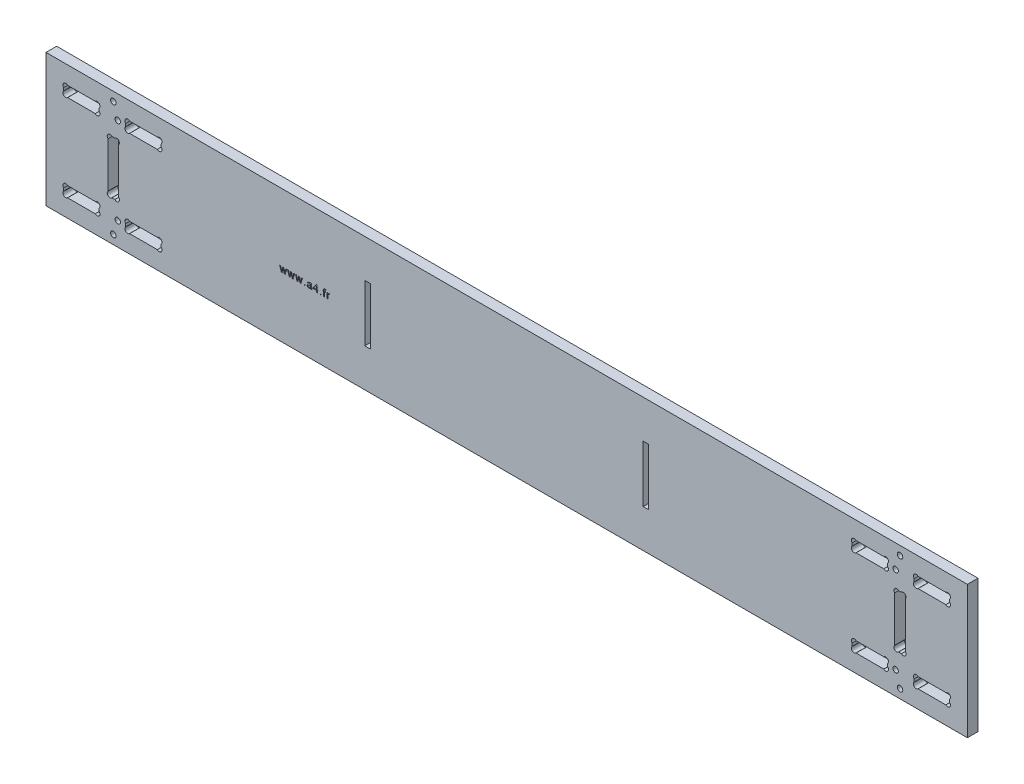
from build123d import *

# Parameters (mm, degrees)
ESQUISSE1_W             = 520
ESQUISSE1_H             = 75
ESQUISSE1_R             = 1.55
ESQUISSE1_W_2           = 3.1
ESQUISSE1_H_2           = 32
EXTRUSION1_DEPTH        = 6
ESQUISSE2_W             = 0.526834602
ESQUISSE2_H             = 0.526834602
ENL_V_MAT_EXTRU_1_DEPTH = 0.5
ESQUISSE3_W             = 0.012820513
ESQUISSE3_H             = 0.012820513
ENL_V_MAT_EXTRU_2_DEPTH = 0.5


with BuildPart() as part:
    # Esquisse1 → Extrusion1 (new body)
    with BuildSketch(Plane.XY):
        with Locations((260, 37.5)):
            Rectangle(ESQUISSE1_W, ESQUISSE1_H)
        with Locations((40.5, 13)):
            Circle(ESQUISSE1_R, mode=Mode.SUBTRACT)
        with Locations((38, 5)):
            Circle(ESQUISSE1_R, mode=Mode.SUBTRACT)
        with Locations(Location((40.5, 62, 0), (0, 0, 180))):
            Circle(ESQUISSE1_R, mode=Mode.SUBTRACT)
        with Locations(Location((38, 70, 0), (0, 0, 180))):
            Circle(ESQUISSE1_R, mode=Mode.SUBTRACT)
        with Locations(Location((482, 5, 0), (0, 0, 180))):
            Circle(ESQUISSE1_R, mode=Mode.SUBTRACT)
        with Locations((482, 70)):
            Circle(ESQUISSE1_R, mode=Mode.SUBTRACT)
        with Locations(Location((479.5, 13, 0), (0, 0, 180))):
            Circle(ESQUISSE1_R, mode=Mode.SUBTRACT)
        with Locations((479.5, 62)):
            Circle(ESQUISSE1_R, mode=Mode.SUBTRACT)
        with BuildLine():
            Line((45, 12.192031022), (45, 13.807968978))
            ThreePointArc((45, 13.807968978), (45, 16), (47.192031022, 16))
            Line((47.192031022, 16), (62.807968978, 16))
            ThreePointArc((62.807968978, 16), (65, 16), (65, 13.807968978))
            Line((65, 13.807968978), (65, 12.192031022))
            ThreePointArc((65, 12.192031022), (65, 10), (62.807968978, 10))
            Line((62.807968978, 10), (47.192031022, 10))
            ThreePointArc((47.192031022, 10), (45, 10), (45, 12.192031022))
        make_face(mode=Mode.SUBTRACT)
        with BuildLine():
            Line((12.192031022, 10), (27.807968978, 10))
            ThreePointArc((27.807968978, 10), (30, 10), (30, 12.192031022))
            Line((30, 12.192031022), (30, 13.807968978))
            ThreePointArc((30, 13.807968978), (30, 16), (27.807968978, 16))
            Line((27.807968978, 16), (12.192031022, 16))
            ThreePointArc((12.192031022, 16), (10, 16), (10, 13.807968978))
            Line((10, 13.807968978), (10, 12.192031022))
            ThreePointArc((10, 12.192031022), (10, 10), (12.192031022, 10))
        make_face(mode=Mode.SUBTRACT)
        with BuildLine():
            Line((65, 62.807968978), (65, 61.192031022))
            ThreePointArc((65, 61.192031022), (65, 59), (62.807968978, 59))
            Line((62.807968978, 59), (47.192031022, 59))
            ThreePointArc((47.192031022, 59), (45, 59), (45, 61.192031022))
            Line((45, 61.192031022), (45, 62.807968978))
            ThreePointArc((45, 62.807968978), (45, 65), (47.192031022, 65))
            Line((47.192031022, 65), (62.807968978, 65))
            ThreePointArc((62.807968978, 65), (65, 65), (65, 62.807968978))
        make_face(mode=Mode.SUBTRACT)
        with BuildLine():
            Line((30, 62.807968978), (30, 61.192031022))
            ThreePointArc((30, 61.192031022), (30, 59), (27.807968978, 59))
            Line((27.807968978, 59), (12.192031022, 59))
            ThreePointArc((12.192031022, 59), (10, 59), (10, 61.192031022))
            Line((10, 61.192031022), (10, 62.807968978))
            ThreePointArc((10, 62.807968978), (10, 65), (12.192031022, 65))
            Line((12.192031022, 65), (27.807968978, 65))
            ThreePointArc((27.807968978, 65), (30, 65), (30, 62.807968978))
        make_face(mode=Mode.SUBTRACT)
        with Locations((338.55, 37.5)):
            Rectangle(ESQUISSE1_W_2, ESQUISSE1_H_2, mode=Mode.SUBTRACT)
        with BuildLine():
            Line((37.192031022, 52.5), (38.807968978, 52.5))
            ThreePointArc((38.807968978, 52.5), (41, 52.5), (41, 50.307968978))
            Line((41, 50.307968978), (41, 24.692031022))
            ThreePointArc((41, 24.692031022), (41, 22.5), (38.807968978, 22.5))
            Line((38.807968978, 22.5), (37.192031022, 22.5))
            ThreePointArc((37.192031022, 22.5), (35, 22.5), (35, 24.692031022))
            Line((35, 24.692031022), (35, 50.307968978))
            ThreePointArc((35, 50.307968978), (35, 52.5), (37.192031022, 52.5))
        make_face(mode=Mode.SUBTRACT)
        with Locations((181.45, 37.5)):
            Rectangle(ESQUISSE1_W_2, ESQUISSE1_H_2, mode=Mode.SUBTRACT)
        with BuildLine():
            Line((485, 50.307968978), (485, 24.692031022))
            ThreePointArc((485, 24.692031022), (485, 22.5), (482.807968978, 22.5))
            Line((482.807968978, 22.5), (481.192031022, 22.5))
            ThreePointArc((481.192031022, 22.5), (479, 22.5), (479, 24.692031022))
            Line((479, 24.692031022), (479, 50.307968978))
            ThreePointArc((479, 50.307968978), (479, 52.5), (481.192031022, 52.5))
            Line((481.192031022, 52.5), (482.807968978, 52.5))
            ThreePointArc((482.807968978, 52.5), (485, 52.5), (485, 50.307968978))
        make_face(mode=Mode.SUBTRACT)
        with BuildLine():
            Line((455, 12.192031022), (455, 13.807968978))
            ThreePointArc((455, 13.807968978), (455, 16), (457.192031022, 16))
            Line((457.192031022, 16), (472.807968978, 16))
            ThreePointArc((472.807968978, 16), (475, 16), (475, 13.807968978))
            Line((475, 13.807968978), (475, 12.192031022))
            ThreePointArc((475, 12.192031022), (475, 10), (472.807968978, 10))
            Line((472.807968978, 10), (457.192031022, 10))
            ThreePointArc((457.192031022, 10), (455, 10), (455, 12.192031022))
        make_face(mode=Mode.SUBTRACT)
        with BuildLine():
            Line((490, 12.192031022), (490, 13.807968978))
            ThreePointArc((490, 13.807968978), (490, 16), (492.192031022, 16))
            Line((492.192031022, 16), (507.807968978, 16))
            ThreePointArc((507.807968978, 16), (510, 16), (510, 13.807968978))
            Line((510, 13.807968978), (510, 12.192031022))
            ThreePointArc((510, 12.192031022), (510, 10), (507.807968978, 10))
            Line((507.807968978, 10), (492.192031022, 10))
            ThreePointArc((492.192031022, 10), (490, 10), (490, 12.192031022))
        make_face(mode=Mode.SUBTRACT)
        with BuildLine():
            Line((510, 62.807968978), (510, 61.192031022))
            ThreePointArc((510, 61.192031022), (510, 59), (507.807968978, 59))
            Line((507.807968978, 59), (492.192031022, 59))
            ThreePointArc((492.192031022, 59), (490, 59), (490, 61.192031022))
            Line((490, 61.192031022), (490, 62.807968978))
            ThreePointArc((490, 62.807968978), (490, 65), (492.192031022, 65))
            Line((492.192031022, 65), (507.807968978, 65))
            ThreePointArc((507.807968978, 65), (510, 65), (510, 62.807968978))
        make_face(mode=Mode.SUBTRACT)
        with BuildLine():
            Line((475, 62.807968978), (475, 61.192031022))
            ThreePointArc((475, 61.192031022), (475, 59), (472.807968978, 59))
            Line((472.807968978, 59), (457.192031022, 59))
            ThreePointArc((457.192031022, 59), (455, 59), (455, 61.192031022))
            Line((455, 61.192031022), (455, 62.807968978))
            ThreePointArc((455, 62.807968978), (455, 65), (457.192031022, 65))
            Line((457.192031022, 65), (472.807968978, 65))
            ThreePointArc((472.807968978, 65), (475, 65), (475, 62.807968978))
        make_face(mode=Mode.SUBTRACT)
    extrude(amount=EXTRUSION1_DEPTH)

    # Esquisse2 → Enl_v. mat.-Extru.1 (cut)
    # profile 1 of 9: a face of its own
    with BuildSketch(Plane.XY.offset(6)):
        with BuildLine():
            Line((132.833430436, 33.973090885), (131.89582948, 36.976048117))
            Line((131.89582948, 36.976048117), (132.444066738, 36.976048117))
            Line((132.444066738, 36.976048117), (132.946205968, 35.225969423))
            Line((132.946205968, 35.225969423), (133.097670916, 34.597883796))
            add(Edge.make_bspline(
                [(133.097670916, 34.597883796), (133.099010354, 34.604476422), (133.102761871, 34.622941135), (133.111524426, 34.658432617), (133.122387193, 34.709956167), (133.138522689, 34.777071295), (133.15834293, 34.86013146), (133.181126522, 34.959250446), (133.207531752, 35.074269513), (133.226607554, 35.15600567), (133.236788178, 35.199627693)],
                knots=[0, 0, 0, 0, 0.261394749, 0.732117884, 1.420242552, 2.307348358, 3.414248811, 4.738505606, 6.259362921, 8, 8, 8, 8], degree=3))
            Line((133.236788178, 35.199627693), (133.681304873, 36.976048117))
            Line((133.681304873, 36.976048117), (134.226249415, 36.976048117))
            Line((134.226249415, 36.976048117), (134.668296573, 35.209505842))
            Line((134.668296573, 35.209505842), (134.793419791, 34.660445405))
            Line((134.793419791, 34.660445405), (134.949823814, 35.230085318))
            Line((134.949823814, 35.230085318), (135.45525576, 36.976048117))
            Line((135.45525576, 36.976048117), (136.005139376, 36.976048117))
            Line((136.005139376, 36.976048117), (135.115282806, 33.973090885))
            Line((135.115282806, 33.973090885), (134.502837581, 33.973090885))
            Line((134.502837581, 33.973090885), (134.073961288, 35.740456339))
            Line((134.073961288, 35.740456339), (133.950484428, 36.282931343))
            Line((133.950484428, 36.282931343), (133.397308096, 33.973090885))
            Line((133.397308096, 33.973090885), (132.833430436, 33.973090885))
        make_face()
    # profile 2 of 9: a face of its own
    with BuildSketch(Plane.XY.offset(6)):
        with BuildLine():
            Line((137.269377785, 33.973090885), (136.331776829, 36.976048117))
            Line((136.331776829, 36.976048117), (136.880014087, 36.976048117))
            Line((136.880014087, 36.976048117), (137.382153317, 35.225969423))
            Line((137.382153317, 35.225969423), (137.533618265, 34.597883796))
            add(Edge.make_bspline(
                [(137.533618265, 34.597883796), (137.534957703, 34.604476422), (137.53870922, 34.622941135), (137.547471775, 34.658432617), (137.558334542, 34.709956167), (137.574470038, 34.777071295), (137.594290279, 34.86013146), (137.617073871, 34.959250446), (137.643479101, 35.074269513), (137.662554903, 35.15600567), (137.672735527, 35.199627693)],
                knots=[0, 0, 0, 0, 0.261394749, 0.732117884, 1.420242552, 2.307348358, 3.414248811, 4.738505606, 6.259362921, 8, 8, 8, 8], degree=3))
            Line((137.672735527, 35.199627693), (138.117252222, 36.976048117))
            Line((138.117252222, 36.976048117), (138.662196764, 36.976048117))
            Line((138.662196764, 36.976048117), (139.104243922, 35.209505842))
            Line((139.104243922, 35.209505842), (139.22936714, 34.660445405))
            Line((139.22936714, 34.660445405), (139.385771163, 35.230085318))
            Line((139.385771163, 35.230085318), (139.891203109, 36.976048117))
            Line((139.891203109, 36.976048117), (140.441086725, 36.976048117))
            Line((140.441086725, 36.976048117), (139.551230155, 33.973090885))
            Line((139.551230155, 33.973090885), (138.93878493, 33.973090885))
            Line((138.93878493, 33.973090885), (138.509908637, 35.740456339))
            Line((138.509908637, 35.740456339), (138.386431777, 36.282931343))
            Line((138.386431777, 36.282931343), (137.833255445, 33.973090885))
            Line((137.833255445, 33.973090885), (137.269377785, 33.973090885))
        make_face()
    # profile 3 of 9: a face of its own
    with BuildSketch(Plane.XY.offset(6)):
        with BuildLine():
            Line((141.705325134, 33.973090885), (140.767724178, 36.976048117))
            Line((140.767724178, 36.976048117), (141.315961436, 36.976048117))
            Line((141.315961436, 36.976048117), (141.818100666, 35.225969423))
            Line((141.818100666, 35.225969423), (141.969565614, 34.597883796))
            add(Edge.make_bspline(
                [(141.969565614, 34.597883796), (141.970905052, 34.604476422), (141.974656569, 34.622941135), (141.983419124, 34.658432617), (141.994281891, 34.709956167), (142.010417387, 34.777071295), (142.030237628, 34.86013146), (142.05302122, 34.959250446), (142.07942645, 35.074269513), (142.098502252, 35.15600567), (142.108682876, 35.199627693)],
                knots=[0, 0, 0, 0, 0.261394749, 0.732117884, 1.420242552, 2.307348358, 3.414248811, 4.738505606, 6.259362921, 8, 8, 8, 8], degree=3))
            Line((142.108682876, 35.199627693), (142.553199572, 36.976048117))
            Line((142.553199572, 36.976048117), (143.098144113, 36.976048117))
            Line((143.098144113, 36.976048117), (143.540191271, 35.209505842))
            Line((143.540191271, 35.209505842), (143.665314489, 34.660445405))
            Line((143.665314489, 34.660445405), (143.821718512, 35.230085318))
            Line((143.821718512, 35.230085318), (144.327150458, 36.976048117))
            Line((144.327150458, 36.976048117), (144.877034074, 36.976048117))
            Line((144.877034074, 36.976048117), (143.987177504, 33.973090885))
            Line((143.987177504, 33.973090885), (143.374732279, 33.973090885))
            Line((143.374732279, 33.973090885), (142.945855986, 35.740456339))
            Line((142.945855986, 35.740456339), (142.822379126, 36.282931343))
            Line((142.822379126, 36.282931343), (142.269202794, 33.973090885))
            Line((142.269202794, 33.973090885), (141.705325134, 33.973090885))
        make_face()
    # profile 4 of 9: a face of its own
    with BuildSketch(Plane.XY.offset(6)):
        with Locations((146.02026516, 34.236508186)):
            Rectangle(ESQUISSE2_W, ESQUISSE2_H)
    # profile 5 of 9: a face of its own
    with BuildSketch(Plane.XY.offset(6)):
        with BuildLine():
            add(Edge.make_bspline(
                [(149.455226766, 34.341875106), (149.409054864, 34.305560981), (149.320099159, 34.235597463), (149.184205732, 34.145039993), (149.052870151, 34.070465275), (148.923470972, 34.013444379), (148.793601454, 33.971887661), (148.661112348, 33.942246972), (148.523931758, 33.923380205), (148.430704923, 33.921407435), (148.383447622, 33.920407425)],
                knots=[0, 0, 0, 0, 1.197047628, 2.306255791, 3.325459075, 4.272204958, 5.183179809, 6.100503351, 7.037132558, 8, 8, 8, 8], degree=3))
            add(Edge.make_bspline(
                [(148.383447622, 33.920407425), (148.345011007, 33.921303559), (148.270455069, 33.923041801), (148.161922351, 33.933424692), (148.060307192, 33.952347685), (147.965438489, 33.978910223), (147.876648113, 34.011163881), (147.795515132, 34.052963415), (147.72093174, 34.101368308), (147.654221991, 34.157679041), (147.595090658, 34.219576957), (147.542731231, 34.285409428), (147.499011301, 34.356053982), (147.462425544, 34.430335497), (147.434215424, 34.509307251), (147.414740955, 34.592437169), (147.403021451, 34.679594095), (147.401398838, 34.738885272), (147.400571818, 34.769105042)],
                knots=[0, 0, 0, 0, 1.258692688, 2.441500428, 3.565802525, 4.638326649, 5.664695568, 6.653201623, 7.620115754, 8.570354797, 9.504485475, 10.41940588, 11.319425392, 12.219534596, 13.126122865, 14.058869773, 15.010636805, 16, 16, 16, 16], degree=3))
            add(Edge.make_bspline(
                [(147.400571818, 34.769105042), (147.401553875, 34.804862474), (147.403485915, 34.875209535), (147.422498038, 34.977955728), (147.451790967, 35.076091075), (147.494230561, 35.168054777), (147.545723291, 35.253320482), (147.605585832, 35.33046478), (147.672081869, 35.399447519), (147.747351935, 35.458007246), (147.828113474, 35.508569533), (147.913518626, 35.553582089), (148.003942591, 35.591440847), (148.066901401, 35.611158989), (148.098627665, 35.621095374)],
                knots=[0, 0, 0, 0, 1.081160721, 2.127011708, 3.15154375, 4.173548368, 5.183333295, 6.160067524, 7.123185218, 8.075175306, 9.03822139, 10.004020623, 10.994184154, 12, 12, 12, 12], degree=3))
            add(Edge.make_bspline(
                [(148.098627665, 35.621095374), (148.125450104, 35.627989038), (148.185015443, 35.643297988), (148.284476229, 35.660947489), (148.401809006, 35.680441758), (148.486297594, 35.691106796), (148.531619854, 35.696827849)],
                knots=[0, 0, 0, 0, 0.755247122, 1.677198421, 2.753978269, 4, 4, 4, 4], degree=3))
            add(Edge.make_bspline(
                [(148.531619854, 35.696827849), (148.579097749, 35.703076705), (148.670819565, 35.715148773), (148.803782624, 35.733676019), (148.926978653, 35.754258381), (149.040491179, 35.775907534), (149.144512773, 35.796636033), (149.238298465, 35.819909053), (149.322713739, 35.843438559), (149.375172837, 35.861243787), (149.400073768, 35.869695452)],
                knots=[0, 0, 0, 0, 1.295688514, 2.50312072, 3.632112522, 4.674678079, 5.629835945, 6.501350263, 7.28863104, 8, 8, 8, 8], degree=3))
            add(Edge.make_bspline(
                [(149.400073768, 35.869695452), (149.400352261, 35.884238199), (149.400856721, 35.910580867), (149.40147557, 35.945707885), (149.402685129, 35.972037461), (149.402583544, 35.986586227), (149.402543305, 35.992349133)],
                knots=[0, 0, 0, 0, 1.422721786, 2.577112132, 3.436380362, 4, 4, 4, 4], degree=3))
            add(Edge.make_bspline(
                [(149.402543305, 35.992349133), (149.401946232, 36.015405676), (149.400799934, 36.059671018), (149.395522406, 36.123615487), (149.384680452, 36.182247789), (149.37007071, 36.235760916), (149.351529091, 36.284264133), (149.326967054, 36.326224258), (149.300130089, 36.364525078), (149.277812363, 36.385353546), (149.26671876, 36.395706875)],
                knots=[0, 0, 0, 0, 1.26154989, 2.42199954, 3.505345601, 4.517638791, 5.454101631, 6.334651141, 7.172195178, 8, 8, 8, 8], degree=3))
            add(Edge.make_bspline(
                [(149.26671876, 36.395706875), (149.250851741, 36.408522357), (149.218407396, 36.434727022), (149.162557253, 36.465857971), (149.102684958, 36.494414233), (149.036562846, 36.516546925), (148.965177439, 36.533545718), (148.888127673, 36.54580963), (148.80561231, 36.553276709), (148.748681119, 36.554136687), (148.719304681, 36.554580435)],
                knots=[0, 0, 0, 0, 0.839762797, 1.717118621, 2.62848608, 3.573318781, 4.586191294, 5.652292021, 6.78858503, 8, 8, 8, 8], degree=3))
            add(Edge.make_bspline(
                [(148.719304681, 36.554580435), (148.691856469, 36.554300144), (148.639107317, 36.553761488), (148.562469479, 36.54864729), (148.491532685, 36.540772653), (148.425811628, 36.529228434), (148.366161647, 36.514547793), (148.31145853, 36.497262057), (148.262462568, 36.476312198), (148.204220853, 36.442660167), (148.138682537, 36.388729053), (148.074517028, 36.303326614), (148.018196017, 36.200251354), (147.993269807, 36.121872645), (147.98008988, 36.080429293)],
                knots=[0, 0, 0, 0, 1.022193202, 1.964420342, 2.859404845, 3.679355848, 4.447752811, 5.145854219, 5.814144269, 6.427678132, 7.647232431, 8.943346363, 10.383770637, 12, 12, 12, 12], degree=3))
            Line((147.98008988, 36.080429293), (147.453255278, 36.133112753))
            add(Edge.make_bspline(
                [(147.453255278, 36.133112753), (147.465343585, 36.182547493), (147.488685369, 36.278002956), (147.540045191, 36.411135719), (147.602207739, 36.529368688), (147.675036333, 36.634913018), (147.764555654, 36.725949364), (147.869556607, 36.806085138), (147.992779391, 36.872894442), (148.131640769, 36.929580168), (148.285051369, 36.974270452), (148.451238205, 37.00603485), (148.628862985, 37.025006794), (148.751086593, 37.027466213), (148.813970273, 37.028731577)],
                knots=[0, 0, 0, 0, 1.021253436, 1.971977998, 2.856928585, 3.699335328, 4.537187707, 5.410097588, 6.342486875, 7.343316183, 8.417452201, 9.545747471, 10.737294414, 12, 12, 12, 12], degree=3))
            add(Edge.make_bspline(
                [(148.813970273, 37.028731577), (148.875472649, 37.027656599), (148.992680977, 37.025607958), (149.159294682, 37.009538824), (149.308059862, 36.982241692), (149.438635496, 36.942698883), (149.552141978, 36.894598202), (149.650141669, 36.841665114), (149.732175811, 36.782149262), (149.79903957, 36.715669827), (149.852679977, 36.641295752), (149.89604284, 36.559008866), (149.932260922, 36.468312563), (149.948267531, 36.403629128), (149.956542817, 36.370188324)],
                knots=[0, 0, 0, 0, 1.532418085, 2.920410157, 4.166262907, 5.295392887, 6.3126657, 7.233843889, 8.065362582, 8.82930282, 9.573337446, 10.341184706, 11.142406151, 12, 12, 12, 12], degree=3))
            add(Edge.make_bspline(
                [(149.956542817, 36.370188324), (149.960797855, 36.344717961), (149.970587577, 36.286117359), (149.976061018, 36.185290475), (149.981531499, 36.060738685), (149.981874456, 35.969587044), (149.982061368, 35.919909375)],
                knots=[0, 0, 0, 0, 0.685842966, 1.577944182, 2.67997895, 4, 4, 4, 4], degree=3))
            Line((149.982061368, 35.919909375), (149.982061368, 35.277006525))
            add(Edge.make_bspline(
                [(149.982061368, 35.277006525), (149.982364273, 35.223225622), (149.982942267, 35.120602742), (149.983323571, 34.973793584), (149.985586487, 34.841512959), (149.990172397, 34.723275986), (149.99396005, 34.619255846), (149.998538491, 34.529192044), (150.005070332, 34.453709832), (150.01473432, 34.372199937), (150.031584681, 34.280802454), (150.060132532, 34.175936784), (150.094824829, 34.072605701), (150.124984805, 34.006331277), (150.140111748, 33.973090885)],
                knots=[0, 0, 0, 0, 1.460752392, 2.787357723, 3.987454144, 5.053844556, 6.001073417, 6.814649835, 7.502887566, 8.058452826, 9.043678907, 10.023506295, 11.008675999, 12, 12, 12, 12], degree=3))
            Line((150.140111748, 33.973090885), (149.613277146, 33.973090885))
            add(Edge.make_bspline(
                [(149.613277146, 33.973090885), (149.593776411, 34.000017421), (149.554804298, 34.053829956), (149.511177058, 34.144392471), (149.475256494, 34.240034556), (149.461969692, 34.307590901), (149.455226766, 34.341875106)],
                knots=[0, 0, 0, 0, 0.98283144, 1.964183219, 2.966842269, 4, 4, 4, 4], degree=3))
        make_face()
        with BuildLine():
            add(Edge.make_bspline(
                [(149.402543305, 35.395544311), (149.379315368, 35.387281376), (149.330295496, 35.369843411), (149.251230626, 35.348848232), (149.164843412, 35.325790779), (149.06956216, 35.305976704), (148.966559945, 35.284993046), (148.854741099, 35.266377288), (148.735086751, 35.248299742), (148.652371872, 35.237359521), (148.609821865, 35.231731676)],
                knots=[0, 0, 0, 0, 0.729352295, 1.539213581, 2.419656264, 3.375381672, 4.41857158, 5.530700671, 6.729748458, 8, 8, 8, 8], degree=3))
            add(Edge.make_bspline(
                [(148.609821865, 35.231731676), (148.563388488, 35.225546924), (148.47768549, 35.214131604), (148.360705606, 35.192805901), (148.265485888, 35.171070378), (148.189400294, 35.148106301), (148.127579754, 35.121030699), (148.076371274, 35.08739859), (148.030988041, 35.049677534), (147.994119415, 35.00554841), (147.964005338, 34.958140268), (147.943715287, 34.906915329), (147.929414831, 34.853845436), (147.928079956, 34.817219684), (147.92740642, 34.798739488)],
                knots=[0, 0, 0, 0, 1.886220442, 3.481434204, 4.78676141, 5.817751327, 6.678319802, 7.493641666, 8.277504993, 9.045791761, 9.800124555, 10.528599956, 11.257578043, 12, 12, 12, 12], degree=3))
            add(Edge.make_bspline(
                [(147.92740642, 34.798739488), (147.928958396, 34.770755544), (147.932008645, 34.715756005), (147.962045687, 34.638024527), (148.008790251, 34.567719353), (148.073798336, 34.505542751), (148.157509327, 34.455308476), (148.258370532, 34.419223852), (148.375742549, 34.39842027), (148.459366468, 34.395895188), (148.503631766, 34.394558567)],
                knots=[0, 0, 0, 0, 0.849267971, 1.669148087, 2.501462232, 3.405991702, 4.385156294, 5.453560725, 6.652073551, 8, 8, 8, 8], degree=3))
            add(Edge.make_bspline(
                [(148.503631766, 34.394558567), (148.549029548, 34.395751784), (148.63801941, 34.398090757), (148.76731623, 34.423266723), (148.889478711, 34.461302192), (149.001755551, 34.516192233), (149.103204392, 34.581201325), (149.191027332, 34.654865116), (149.265821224, 34.735193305), (149.303311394, 34.795866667), (149.321871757, 34.825904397)],
                knots=[0, 0, 0, 0, 1.124426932, 2.204129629, 3.254288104, 4.289056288, 5.293189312, 6.235005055, 7.126199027, 8, 8, 8, 8], degree=3))
            add(Edge.make_bspline(
                [(149.321871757, 34.825904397), (149.33438745, 34.851889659), (149.361300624, 34.907767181), (149.382478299, 35.005620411), (149.397968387, 35.118439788), (149.399340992, 35.199277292), (149.400073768, 35.242433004)],
                knots=[0, 0, 0, 0, 0.806621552, 1.73452216, 2.790557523, 4, 4, 4, 4], degree=3))
            Line((149.400073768, 35.242433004), (149.402543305, 35.395544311))
        make_face(mode=Mode.SUBTRACT)
    # profile 6 of 9: a face of its own
    with BuildSketch(Plane.XY.offset(6)):
        Polygon((152.57408761, 33.973090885), (152.57408761, 34.974076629), (150.782849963, 34.974076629), (150.782849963, 35.500911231), (152.73213799, 38.029717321), (153.100922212, 38.029717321), (153.100922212, 35.500911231), (153.627756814, 35.500911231), (153.627756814, 34.974076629), (153.100922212, 34.974076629), (153.100922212, 33.973090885), align=None)
        Polygon((152.57408761, 35.500911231), (152.57408761, 36.980987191), (151.433161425, 35.500911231), align=None, mode=Mode.SUBTRACT)
    # profile 7 of 9: a face of its own
    with BuildSketch(Plane.XY.offset(6)):
        with Locations((155.060746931, 34.236508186)):
            Rectangle(ESQUISSE2_W, ESQUISSE2_H)
    # profile 8 of 9: a face of its own
    with BuildSketch(Plane.XY.offset(6)):
        with BuildLine():
            Line((156.725050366, 33.973090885), (156.725050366, 36.501896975))
            Line((156.725050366, 36.501896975), (156.303582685, 36.501896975))
            Line((156.303582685, 36.501896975), (156.303582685, 36.976048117))
            Line((156.303582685, 36.976048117), (156.725050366, 36.976048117))
            Line((156.725050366, 36.976048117), (156.725050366, 37.28144755))
            add(Edge.make_bspline(
                [(156.725050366, 37.28144755), (156.725470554, 37.326486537), (156.726255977, 37.410674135), (156.737249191, 37.527474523), (156.752477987, 37.626823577), (156.772077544, 37.684714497), (156.781026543, 37.711147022)],
                knots=[0, 0, 0, 0, 1.240410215, 2.318594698, 3.232283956, 4, 4, 4, 4], degree=3))
            add(Edge.make_bspline(
                [(156.781026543, 37.711147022), (156.795100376, 37.741624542), (156.823353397, 37.802807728), (156.884744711, 37.885011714), (156.961234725, 37.956984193), (157.050755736, 38.021215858), (157.156629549, 38.074093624), (157.280548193, 38.108955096), (157.420362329, 38.131495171), (157.519318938, 38.133848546), (157.571278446, 38.135084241)],
                knots=[0, 0, 0, 0, 0.841887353, 1.690076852, 2.558213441, 3.472839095, 4.450413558, 5.515111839, 6.695250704, 8, 8, 8, 8], degree=3))
            add(Edge.make_bspline(
                [(157.571278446, 38.135084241), (157.607522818, 38.134444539), (157.681784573, 38.133133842), (157.795706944, 38.122231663), (157.915383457, 38.107349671), (157.996395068, 38.091412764), (158.038020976, 38.08322396)],
                knots=[0, 0, 0, 0, 0.924505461, 1.89423605, 2.918002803, 4, 4, 4, 4], degree=3))
            Line((158.038020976, 38.08322396), (157.963111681, 37.634591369))
            add(Edge.make_bspline(
                [(157.963111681, 37.634591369), (157.912719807, 37.642272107), (157.815025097, 37.657162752), (157.716242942, 37.659703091), (157.668413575, 37.660933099)],
                knots=[0, 0, 0, 0, 1.031619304, 2, 2, 2, 2], degree=3))
            add(Edge.make_bspline(
                [(157.668413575, 37.660933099), (157.633198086, 37.660042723), (157.567758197, 37.658388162), (157.477749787, 37.641176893), (157.402857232, 37.614191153), (157.343117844, 37.572338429), (157.299442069, 37.512658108), (157.272185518, 37.434804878), (157.25407328, 37.339080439), (157.252655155, 37.268657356), (157.251884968, 37.230410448)],
                knots=[0, 0, 0, 0, 1.201235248, 2.232219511, 3.116244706, 3.901648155, 4.685036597, 5.598662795, 6.695829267, 8, 8, 8, 8], degree=3))
            Line((157.251884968, 37.230410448), (157.251884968, 36.976048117))
            Line((157.251884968, 36.976048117), (157.77871957, 36.976048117))
            Line((157.77871957, 36.976048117), (157.77871957, 36.501896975))
            Line((157.77871957, 36.501896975), (157.251884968, 36.501896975))
            Line((157.251884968, 36.501896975), (157.251884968, 33.973090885))
            Line((157.251884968, 33.973090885), (156.725050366, 33.973090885))
        make_face()
    # profile 9 of 9: a face of its own
    with BuildSketch(Plane.XY.offset(6)):
        with BuildLine():
            Line((158.558928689, 33.973090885), (158.558928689, 36.976048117))
            Line((158.558928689, 36.976048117), (159.03307983, 36.976048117))
            Line((159.03307983, 36.976048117), (159.03307983, 36.557049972))
            add(Edge.make_bspline(
                [(159.03307983, 36.557049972), (159.059602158, 36.601367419), (159.108738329, 36.683471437), (159.186235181, 36.791663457), (159.259972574, 36.876400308), (159.334409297, 36.936778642), (159.4089001, 36.978565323), (159.484963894, 37.007333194), (159.564544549, 37.025607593), (159.618810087, 37.027679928), (159.646348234, 37.028731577)],
                knots=[0, 0, 0, 0, 1.517336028, 2.811068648, 3.907416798, 4.807929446, 5.613162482, 6.406966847, 7.191583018, 8, 8, 8, 8], degree=3))
            add(Edge.make_bspline(
                [(159.646348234, 37.028731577), (159.687105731, 37.026912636), (159.769716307, 37.023225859), (159.893494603, 36.994931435), (160.018737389, 36.952033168), (160.098507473, 36.909691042), (160.139432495, 36.887967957)],
                knots=[0, 0, 0, 0, 0.943117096, 1.911585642, 2.928565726, 4, 4, 4, 4], degree=3))
            Line((160.139432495, 36.887967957), (159.974796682, 36.431103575))
            add(Edge.make_bspline(
                [(159.974796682, 36.431103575), (159.946214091, 36.450107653), (159.891089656, 36.486758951), (159.802700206, 36.525576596), (159.714381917, 36.550351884), (159.655008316, 36.553185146), (159.625768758, 36.554580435)],
                knots=[0, 0, 0, 0, 1.093324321, 2.108587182, 3.068540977, 4, 4, 4, 4], degree=3))
            add(Edge.make_bspline(
                [(159.625768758, 36.554580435), (159.600405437, 36.553291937), (159.550326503, 36.550747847), (159.477154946, 36.530987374), (159.408313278, 36.498328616), (159.343854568, 36.453776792), (159.286525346, 36.397462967), (159.23620842, 36.331603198), (159.195547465, 36.255040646), (159.176875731, 36.199014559), (159.167258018, 36.170155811)],
                knots=[0, 0, 0, 0, 0.946345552, 1.868524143, 2.808299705, 3.780481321, 4.780563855, 5.797153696, 6.865325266, 8, 8, 8, 8], degree=3))
            add(Edge.make_bspline(
                [(159.167258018, 36.170155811), (159.154697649, 36.123404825), (159.129196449, 36.028486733), (159.104711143, 35.880791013), (159.08815613, 35.726842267), (159.086572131, 35.621965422), (159.085763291, 35.568411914)],
                knots=[0, 0, 0, 0, 0.953038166, 1.934944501, 2.945515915, 4, 4, 4, 4], degree=3))
            Line((159.085763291, 35.568411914), (159.085763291, 33.973090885))
            Line((159.085763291, 33.973090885), (158.558928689, 33.973090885))
        make_face()
    extrude(amount=-ENL_V_MAT_EXTRU_1_DEPTH, mode=Mode.SUBTRACT)

    # Esquisse3 → Enl_v. mat.-Extru.2 (cut)
    # profile 1 of 9: a face of its own
    with BuildSketch(Plane.XY.offset(3)):
        with BuildLine():
            Line((0.071577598, 0.053550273), (0.048761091, 0.126627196))
            Line((0.048761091, 0.126627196), (0.062102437, 0.126627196))
            Line((0.062102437, 0.126627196), (0.074321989, 0.084039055))
            Line((0.074321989, 0.084039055), (0.078007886, 0.0687546))
            add(Edge.make_bspline(
                [(0.078007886, 0.0687546), (0.078040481, 0.068915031), (0.078131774, 0.06936437), (0.078345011, 0.070228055), (0.078609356, 0.07148188), (0.079002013, 0.073115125), (0.079484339, 0.075136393), (0.080038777, 0.077548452), (0.080681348, 0.08034744), (0.081145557, 0.082336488), (0.081393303, 0.083398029)],
                knots=[0, 0, 0, 0, 0.261394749, 0.732117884, 1.420242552, 2.307348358, 3.414248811, 4.738505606, 6.259362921, 8, 8, 8, 8], degree=3))
            Line((0.081393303, 0.083398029), (0.09221061, 0.126627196))
            Line((0.09221061, 0.126627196), (0.105471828, 0.126627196))
            Line((0.105471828, 0.126627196), (0.11622904, 0.083638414))
            Line((0.11622904, 0.083638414), (0.119273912, 0.070277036))
            Line((0.119273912, 0.070277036), (0.123080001, 0.084139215))
            Line((0.123080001, 0.084139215), (0.135379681, 0.126627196))
            Line((0.135379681, 0.126627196), (0.148761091, 0.126627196))
            Line((0.148761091, 0.126627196), (0.127106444, 0.053550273))
            Line((0.127106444, 0.053550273), (0.112202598, 0.053550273))
            Line((0.112202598, 0.053550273), (0.101765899, 0.096559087))
            Line((0.101765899, 0.096559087), (0.098761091, 0.109760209))
            Line((0.098761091, 0.109760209), (0.085299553, 0.053550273))
            Line((0.085299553, 0.053550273), (0.071577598, 0.053550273))
        make_face()
    # profile 2 of 9: a face of its own
    with BuildSketch(Plane.XY.offset(3)):
        with BuildLine():
            Line((0.170295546, 0.053550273), (0.14747904, 0.126627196))
            Line((0.14747904, 0.126627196), (0.160820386, 0.126627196))
            Line((0.160820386, 0.126627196), (0.173039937, 0.084039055))
            Line((0.173039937, 0.084039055), (0.176725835, 0.0687546))
            add(Edge.make_bspline(
                [(0.176725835, 0.0687546), (0.17675843, 0.068915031), (0.176849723, 0.06936437), (0.17706296, 0.070228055), (0.177327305, 0.07148188), (0.177719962, 0.073115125), (0.178202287, 0.075136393), (0.178756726, 0.077548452), (0.179399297, 0.08034744), (0.179863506, 0.082336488), (0.180111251, 0.083398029)],
                knots=[0, 0, 0, 0, 0.261394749, 0.732117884, 1.420242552, 2.307348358, 3.414248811, 4.738505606, 6.259362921, 8, 8, 8, 8], degree=3))
            Line((0.180111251, 0.083398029), (0.190928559, 0.126627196))
            Line((0.190928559, 0.126627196), (0.204189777, 0.126627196))
            Line((0.204189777, 0.126627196), (0.214946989, 0.083638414))
            Line((0.214946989, 0.083638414), (0.21799186, 0.070277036))
            Line((0.21799186, 0.070277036), (0.22179795, 0.084139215))
            Line((0.22179795, 0.084139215), (0.23409763, 0.126627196))
            Line((0.23409763, 0.126627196), (0.24747904, 0.126627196))
            Line((0.24747904, 0.126627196), (0.225824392, 0.053550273))
            Line((0.225824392, 0.053550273), (0.210920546, 0.053550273))
            Line((0.210920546, 0.053550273), (0.200483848, 0.096559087))
            Line((0.200483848, 0.096559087), (0.19747904, 0.109760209))
            Line((0.19747904, 0.109760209), (0.184017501, 0.053550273))
            Line((0.184017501, 0.053550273), (0.170295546, 0.053550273))
        make_face()
    # profile 3 of 9: a face of its own
    with BuildSketch(Plane.XY.offset(3)):
        with BuildLine():
            Line((0.269013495, 0.053550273), (0.246196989, 0.126627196))
            Line((0.246196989, 0.126627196), (0.259538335, 0.126627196))
            Line((0.259538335, 0.126627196), (0.271757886, 0.084039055))
            Line((0.271757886, 0.084039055), (0.275443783, 0.0687546))
            add(Edge.make_bspline(
                [(0.275443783, 0.0687546), (0.275476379, 0.068915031), (0.275567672, 0.06936437), (0.275780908, 0.070228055), (0.276045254, 0.07148188), (0.276437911, 0.073115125), (0.276920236, 0.075136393), (0.277474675, 0.077548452), (0.278117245, 0.08034744), (0.278581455, 0.082336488), (0.2788292, 0.083398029)],
                knots=[0, 0, 0, 0, 0.261394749, 0.732117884, 1.420242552, 2.307348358, 3.414248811, 4.738505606, 6.259362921, 8, 8, 8, 8], degree=3))
            Line((0.2788292, 0.083398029), (0.289646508, 0.126627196))
            Line((0.289646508, 0.126627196), (0.302907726, 0.126627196))
            Line((0.302907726, 0.126627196), (0.313664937, 0.083638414))
            Line((0.313664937, 0.083638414), (0.316709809, 0.070277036))
            Line((0.316709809, 0.070277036), (0.320515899, 0.084139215))
            Line((0.320515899, 0.084139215), (0.332815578, 0.126627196))
            Line((0.332815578, 0.126627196), (0.346196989, 0.126627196))
            Line((0.346196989, 0.126627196), (0.324542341, 0.053550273))
            Line((0.324542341, 0.053550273), (0.309638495, 0.053550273))
            Line((0.309638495, 0.053550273), (0.299201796, 0.096559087))
            Line((0.299201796, 0.096559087), (0.296196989, 0.109760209))
            Line((0.296196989, 0.109760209), (0.28273545, 0.053550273))
            Line((0.28273545, 0.053550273), (0.269013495, 0.053550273))
        make_face()
    # profile 4 of 9: a face of its own
    with BuildSketch(Plane.XY.offset(3)):
        with Locations((0.364786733, 0.059960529)):
            Rectangle(ESQUISSE3_W, ESQUISSE3_H)
    # profile 5 of 9: a face of its own
    with BuildSketch(Plane.XY.offset(3)):
        with BuildLine():
            add(Edge.make_bspline(
                [(0.439145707, 0.062524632), (0.438022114, 0.061640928), (0.435857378, 0.059938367), (0.432550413, 0.057734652), (0.429354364, 0.055919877), (0.426205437, 0.054532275), (0.423045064, 0.053520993), (0.419820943, 0.052799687), (0.416482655, 0.052340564), (0.414213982, 0.052292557), (0.413063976, 0.052268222)],
                knots=[0, 0, 0, 0, 1.197047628, 2.306255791, 3.325459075, 4.272204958, 5.183179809, 6.100503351, 7.037132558, 8, 8, 8, 8], degree=3))
            add(Edge.make_bspline(
                [(0.413063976, 0.052268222), (0.412128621, 0.052290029), (0.410314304, 0.052332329), (0.407673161, 0.052584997), (0.405200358, 0.053045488), (0.402891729, 0.053691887), (0.400731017, 0.054476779), (0.398756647, 0.05549397), (0.396941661, 0.056671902), (0.39531828, 0.058042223), (0.39387932, 0.059548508), (0.392605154, 0.06115054), (0.39154123, 0.062869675), (0.390650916, 0.064677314), (0.389964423, 0.066599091), (0.389490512, 0.068622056), (0.389205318, 0.070743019), (0.389165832, 0.072185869), (0.389145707, 0.072921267)],
                knots=[0, 0, 0, 0, 1.258692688, 2.441500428, 3.565802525, 4.638326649, 5.664695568, 6.653201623, 7.620115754, 8.570354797, 9.504485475, 10.41940588, 11.319425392, 12.219534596, 13.126122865, 14.058869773, 15.010636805, 16, 16, 16, 16], degree=3))
            add(Edge.make_bspline(
                [(0.389145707, 0.072921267), (0.389169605, 0.073791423), (0.389216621, 0.075503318), (0.389679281, 0.078003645), (0.390392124, 0.080391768), (0.391424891, 0.082629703), (0.392677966, 0.084704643), (0.39413472, 0.086581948), (0.3957529, 0.088260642), (0.397584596, 0.089685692), (0.399549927, 0.090916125), (0.40162826, 0.092011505), (0.403828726, 0.092932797), (0.405360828, 0.093412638), (0.406132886, 0.09365444)],
                knots=[0, 0, 0, 0, 1.081160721, 2.127011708, 3.15154375, 4.173548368, 5.183333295, 6.160067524, 7.123185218, 8.075175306, 9.03822139, 10.004020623, 10.994184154, 12, 12, 12, 12], degree=3))
            add(Edge.make_bspline(
                [(0.406132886, 0.09365444), (0.40678561, 0.093822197), (0.408235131, 0.09419474), (0.410655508, 0.09462424), (0.4135108, 0.095098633), (0.415566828, 0.095358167), (0.416669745, 0.095497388)],
                knots=[0, 0, 0, 0, 0.755247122, 1.677198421, 2.753978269, 4, 4, 4, 4], degree=3))
            add(Edge.make_bspline(
                [(0.416669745, 0.095497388), (0.417825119, 0.095649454), (0.420057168, 0.095943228), (0.423292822, 0.096394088), (0.426290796, 0.09689496), (0.429053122, 0.097421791), (0.431584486, 0.097926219), (0.433866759, 0.098492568), (0.435921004, 0.099065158), (0.437197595, 0.099498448), (0.437803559, 0.099704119)],
                knots=[0, 0, 0, 0, 1.295688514, 2.50312072, 3.632112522, 4.674678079, 5.629835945, 6.501350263, 7.28863104, 8, 8, 8, 8], degree=3))
            add(Edge.make_bspline(
                [(0.437803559, 0.099704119), (0.437810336, 0.100058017), (0.437822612, 0.100699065), (0.437837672, 0.101553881), (0.437867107, 0.102194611), (0.437864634, 0.102548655), (0.437863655, 0.102688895)],
                knots=[0, 0, 0, 0, 1.422721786, 2.577112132, 3.436380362, 4, 4, 4, 4], degree=3))
            add(Edge.make_bspline(
                [(0.437863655, 0.102688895), (0.437849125, 0.103249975), (0.43782123, 0.104327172), (0.437692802, 0.10588326), (0.437428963, 0.107310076), (0.437073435, 0.108612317), (0.436622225, 0.109792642), (0.436024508, 0.110813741), (0.435371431, 0.111745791), (0.434828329, 0.112252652), (0.434558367, 0.1125046)],
                knots=[0, 0, 0, 0, 1.26154989, 2.42199954, 3.505345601, 4.517638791, 5.454101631, 6.334651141, 7.172195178, 8, 8, 8, 8], degree=3))
            add(Edge.make_bspline(
                [(0.434558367, 0.1125046), (0.434172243, 0.112816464), (0.43338271, 0.113454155), (0.432023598, 0.114211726), (0.430566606, 0.114906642), (0.428957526, 0.115445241), (0.427220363, 0.115858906), (0.425345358, 0.116157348), (0.423337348, 0.11633906), (0.421951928, 0.116359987), (0.421237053, 0.116370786)],
                knots=[0, 0, 0, 0, 0.839762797, 1.717118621, 2.62848608, 3.573318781, 4.586191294, 5.652292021, 6.78858503, 8, 8, 8, 8], degree=3))
            add(Edge.make_bspline(
                [(0.421237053, 0.116370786), (0.420569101, 0.116363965), (0.419285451, 0.116350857), (0.41742047, 0.116226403), (0.415694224, 0.116034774), (0.414094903, 0.115753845), (0.412643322, 0.115396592), (0.411312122, 0.114975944), (0.410119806, 0.114466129), (0.408702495, 0.113647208), (0.407107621, 0.112334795), (0.405546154, 0.110256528), (0.404175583, 0.107748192), (0.403569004, 0.105840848), (0.403248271, 0.104832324)],
                knots=[0, 0, 0, 0, 1.022193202, 1.964420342, 2.859404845, 3.679355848, 4.447752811, 5.145854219, 5.814144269, 6.427678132, 7.647232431, 8.943346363, 10.383770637, 12, 12, 12, 12], degree=3))
            Line((0.403248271, 0.104832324), (0.390427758, 0.106114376))
            add(Edge.make_bspline(
                [(0.390427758, 0.106114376), (0.390721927, 0.107317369), (0.391289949, 0.109640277), (0.392539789, 0.112880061), (0.394052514, 0.115757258), (0.395824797, 0.118325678), (0.398003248, 0.120541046), (0.400558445, 0.122491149), (0.40355707, 0.124116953), (0.406936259, 0.125496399), (0.410669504, 0.126583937), (0.414713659, 0.127356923), (0.419036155, 0.127818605), (0.422010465, 0.127878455), (0.423540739, 0.127909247)],
                knots=[0, 0, 0, 0, 1.021253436, 1.971977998, 2.856928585, 3.699335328, 4.537187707, 5.410097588, 6.342486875, 7.343316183, 8.417452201, 9.545747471, 10.737294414, 12, 12, 12, 12], degree=3))
            add(Edge.make_bspline(
                [(0.423540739, 0.127909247), (0.425037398, 0.127883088), (0.427889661, 0.127833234), (0.431944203, 0.127442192), (0.435564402, 0.126777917), (0.438741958, 0.125815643), (0.441504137, 0.124645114), (0.443888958, 0.123356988), (0.445885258, 0.12190867), (0.447512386, 0.120290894), (0.448817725, 0.118481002), (0.44987296, 0.116478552), (0.450754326, 0.114271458), (0.451143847, 0.112697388), (0.451345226, 0.111883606)],
                knots=[0, 0, 0, 0, 1.532418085, 2.920410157, 4.166262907, 5.295392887, 6.3126657, 7.233843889, 8.065362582, 8.82930282, 9.573337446, 10.341184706, 11.142406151, 12, 12, 12, 12], degree=3))
            add(Edge.make_bspline(
                [(0.451345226, 0.111883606), (0.451448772, 0.111263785), (0.451687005, 0.109837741), (0.451820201, 0.10738412), (0.451953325, 0.104353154), (0.451961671, 0.10213498), (0.451966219, 0.100926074)],
                knots=[0, 0, 0, 0, 0.685842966, 1.577944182, 2.67997895, 4, 4, 4, 4], degree=3))
            Line((0.451966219, 0.100926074), (0.451966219, 0.085281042))
            add(Edge.make_bspline(
                [(0.451966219, 0.085281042), (0.451973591, 0.083972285), (0.451987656, 0.081474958), (0.451996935, 0.077902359), (0.452052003, 0.074683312), (0.452163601, 0.071806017), (0.452255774, 0.069274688), (0.45236719, 0.067082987), (0.452526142, 0.065246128), (0.452761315, 0.063262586), (0.453171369, 0.06103843), (0.45386608, 0.058486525), (0.454710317, 0.055971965), (0.455444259, 0.054359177), (0.455812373, 0.053550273)],
                knots=[0, 0, 0, 0, 1.460752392, 2.787357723, 3.987454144, 5.053844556, 6.001073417, 6.814649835, 7.502887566, 8.058452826, 9.043678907, 10.023506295, 11.008675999, 12, 12, 12, 12], degree=3))
            Line((0.455812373, 0.053550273), (0.44299186, 0.053550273))
            add(Edge.make_bspline(
                [(0.44299186, 0.053550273), (0.44251731, 0.05420553), (0.441568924, 0.055515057), (0.440507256, 0.057718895), (0.43963313, 0.060046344), (0.439309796, 0.061690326), (0.439145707, 0.062524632)],
                knots=[0, 0, 0, 0, 0.98283144, 1.964183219, 2.966842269, 4, 4, 4, 4], degree=3))
        make_face()
        with BuildLine():
            add(Edge.make_bspline(
                [(0.437863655, 0.088165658), (0.437298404, 0.087964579), (0.436105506, 0.087540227), (0.434181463, 0.087029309), (0.432079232, 0.086468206), (0.429760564, 0.085986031), (0.427254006, 0.085475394), (0.424532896, 0.08502238), (0.421621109, 0.084582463), (0.419608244, 0.084316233), (0.41857279, 0.084179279)],
                knots=[0, 0, 0, 0, 0.729352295, 1.539213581, 2.419656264, 3.375381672, 4.41857158, 5.530700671, 6.729748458, 8, 8, 8, 8], degree=3))
            add(Edge.make_bspline(
                [(0.41857279, 0.084179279), (0.417442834, 0.084028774), (0.415357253, 0.083750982), (0.412510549, 0.083232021), (0.410193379, 0.082703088), (0.408341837, 0.082144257), (0.406837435, 0.081485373), (0.405591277, 0.080666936), (0.404486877, 0.079748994), (0.403589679, 0.078675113), (0.402856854, 0.077521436), (0.402363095, 0.076274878), (0.402015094, 0.074983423), (0.40198261, 0.074092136), (0.401966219, 0.07364242)],
                knots=[0, 0, 0, 0, 1.886220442, 3.481434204, 4.78676141, 5.817751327, 6.678319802, 7.493641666, 8.277504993, 9.045791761, 9.800124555, 10.528599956, 11.257578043, 12, 12, 12, 12], degree=3))
            add(Edge.make_bspline(
                [(0.401966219, 0.07364242), (0.402003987, 0.072961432), (0.402078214, 0.071623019), (0.402809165, 0.069731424), (0.403946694, 0.068020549), (0.405528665, 0.066507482), (0.40756577, 0.065285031), (0.410020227, 0.064406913), (0.412876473, 0.063900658), (0.41491146, 0.06383921), (0.415988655, 0.063806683)],
                knots=[0, 0, 0, 0, 0.849267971, 1.669148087, 2.501462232, 3.405991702, 4.385156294, 5.453560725, 6.652073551, 8, 8, 8, 8], degree=3))
            add(Edge.make_bspline(
                [(0.415988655, 0.063806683), (0.41709341, 0.06383572), (0.419258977, 0.063892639), (0.422405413, 0.064505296), (0.425378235, 0.065430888), (0.428110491, 0.066766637), (0.430579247, 0.068348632), (0.432716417, 0.07014124), (0.434536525, 0.072096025), (0.435448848, 0.07357251), (0.435900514, 0.074303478)],
                knots=[0, 0, 0, 0, 1.124426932, 2.204129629, 3.254288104, 4.289056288, 5.293189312, 6.235005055, 7.126199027, 8, 8, 8, 8], degree=3))
            add(Edge.make_bspline(
                [(0.435900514, 0.074303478), (0.436205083, 0.074935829), (0.436860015, 0.076295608), (0.437375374, 0.078676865), (0.437752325, 0.081422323), (0.437785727, 0.083389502), (0.437803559, 0.084439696)],
                knots=[0, 0, 0, 0, 0.806621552, 1.73452216, 2.790557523, 4, 4, 4, 4], degree=3))
            Line((0.437803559, 0.084439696), (0.437863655, 0.088165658))
        make_face(mode=Mode.SUBTRACT)
    # profile 6 of 9: a face of its own
    with BuildSketch(Plane.XY.offset(3)):
        Polygon((0.505812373, 0.053550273), (0.505812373, 0.077909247), (0.46222263, 0.077909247), (0.46222263, 0.09072976), (0.509658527, 0.152268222), (0.518632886, 0.152268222), (0.518632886, 0.09072976), (0.531453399, 0.09072976), (0.531453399, 0.077909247), (0.518632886, 0.077909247), (0.518632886, 0.053550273), align=None)
        Polygon((0.505812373, 0.09072976), (0.505812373, 0.126747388), (0.47804795, 0.09072976), align=None, mode=Mode.SUBTRACT)
    # profile 7 of 9: a face of its own
    with BuildSketch(Plane.XY.offset(3)):
        with Locations((0.557094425, 0.059960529)):
            Rectangle(ESQUISSE3_W, ESQUISSE3_H)
    # profile 8 of 9: a face of its own
    with BuildSketch(Plane.XY.offset(3)):
        with BuildLine():
            Line((0.588364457, 0.053550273), (0.588364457, 0.115088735))
            Line((0.588364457, 0.115088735), (0.578108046, 0.115088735))
            Line((0.578108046, 0.115088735), (0.578108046, 0.126627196))
            Line((0.578108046, 0.126627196), (0.588364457, 0.126627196))
            Line((0.588364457, 0.126627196), (0.588364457, 0.134059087))
            add(Edge.make_bspline(
                [(0.588364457, 0.134059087), (0.588374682, 0.13515511), (0.588393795, 0.137203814), (0.588661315, 0.14004615), (0.589031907, 0.142463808), (0.589508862, 0.143872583), (0.589726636, 0.144515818)],
                knots=[0, 0, 0, 0, 1.240410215, 2.318594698, 3.232283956, 4, 4, 4, 4], degree=3))
            add(Edge.make_bspline(
                [(0.589726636, 0.144515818), (0.590069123, 0.145257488), (0.590756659, 0.14674638), (0.592250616, 0.148746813), (0.594112, 0.150498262), (0.596290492, 0.152061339), (0.59886693, 0.153348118), (0.601882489, 0.154196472), (0.605284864, 0.154744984), (0.607692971, 0.154802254), (0.608957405, 0.154832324)],
                knots=[0, 0, 0, 0, 0.841887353, 1.690076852, 2.558213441, 3.472839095, 4.450413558, 5.515111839, 6.695250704, 8, 8, 8, 8], degree=3))
            add(Edge.make_bspline(
                [(0.608957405, 0.154832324), (0.609839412, 0.154816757), (0.61164657, 0.154784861), (0.61441887, 0.154519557), (0.617331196, 0.154157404), (0.619302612, 0.153769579), (0.620315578, 0.153570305)],
                knots=[0, 0, 0, 0, 0.924505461, 1.89423605, 2.918002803, 4, 4, 4, 4], degree=3))
            Line((0.620315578, 0.153570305), (0.618492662, 0.142652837))
            add(Edge.make_bspline(
                [(0.618492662, 0.142652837), (0.617266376, 0.142839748), (0.614888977, 0.143202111), (0.612485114, 0.143263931), (0.611321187, 0.143293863)],
                knots=[0, 0, 0, 0, 1.031619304, 2, 2, 2, 2], degree=3))
            add(Edge.make_bspline(
                [(0.611321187, 0.143293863), (0.610464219, 0.143272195), (0.60887174, 0.143231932), (0.606681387, 0.142813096), (0.604858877, 0.142156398), (0.60340512, 0.141137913), (0.602342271, 0.139685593), (0.601678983, 0.137791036), (0.601238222, 0.135461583), (0.601203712, 0.133747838), (0.601184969, 0.1328171)],
                knots=[0, 0, 0, 0, 1.201235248, 2.232219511, 3.116244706, 3.901648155, 4.685036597, 5.598662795, 6.695829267, 8, 8, 8, 8], degree=3))
            Line((0.601184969, 0.1328171), (0.601184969, 0.126627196))
            Line((0.601184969, 0.126627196), (0.614005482, 0.126627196))
            Line((0.614005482, 0.126627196), (0.614005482, 0.115088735))
            Line((0.614005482, 0.115088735), (0.601184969, 0.115088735))
            Line((0.601184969, 0.115088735), (0.601184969, 0.053550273))
            Line((0.601184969, 0.053550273), (0.588364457, 0.053550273))
        make_face()
    # profile 9 of 9: a face of its own
    with BuildSketch(Plane.XY.offset(3)):
        with BuildLine():
            Line((0.623761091, 0.053550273), (0.623761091, 0.126627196))
            Line((0.623761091, 0.126627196), (0.635299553, 0.126627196))
            Line((0.635299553, 0.126627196), (0.635299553, 0.116430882))
            add(Edge.make_bspline(
                [(0.635299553, 0.116430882), (0.635944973, 0.117509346), (0.637140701, 0.119507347), (0.639026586, 0.122140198), (0.640820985, 0.124202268), (0.642632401, 0.125671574), (0.644445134, 0.126688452), (0.646296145, 0.127388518), (0.648232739, 0.127833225), (0.64955329, 0.127883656), (0.650223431, 0.127909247)],
                knots=[0, 0, 0, 0, 1.517336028, 2.811068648, 3.907416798, 4.807929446, 5.613162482, 6.406966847, 7.191583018, 8, 8, 8, 8], degree=3))
            add(Edge.make_bspline(
                [(0.650223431, 0.127909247), (0.651215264, 0.127864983), (0.653225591, 0.127775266), (0.656237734, 0.127086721), (0.659285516, 0.126042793), (0.66122672, 0.125012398), (0.66222263, 0.124483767)],
                knots=[0, 0, 0, 0, 0.943117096, 1.911585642, 2.928565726, 4, 4, 4, 4], degree=3))
            Line((0.66222263, 0.124483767), (0.658216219, 0.113365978))
            add(Edge.make_bspline(
                [(0.658216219, 0.113365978), (0.657520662, 0.113828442), (0.65617921, 0.114720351), (0.654028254, 0.115664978), (0.65187903, 0.116267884), (0.650434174, 0.116336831), (0.64972263, 0.116370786)],
                knots=[0, 0, 0, 0, 1.093324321, 2.108587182, 3.068540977, 4, 4, 4, 4], degree=3))
            add(Edge.make_bspline(
                [(0.64972263, 0.116370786), (0.649105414, 0.11633943), (0.647886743, 0.11627752), (0.646106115, 0.115796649), (0.644430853, 0.115001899), (0.642862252, 0.113917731), (0.641467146, 0.112547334), (0.640242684, 0.110944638), (0.6392532, 0.109081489), (0.638798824, 0.107718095), (0.638564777, 0.107015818)],
                knots=[0, 0, 0, 0, 0.946345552, 1.868524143, 2.808299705, 3.780481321, 4.780563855, 5.797153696, 6.865325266, 8, 8, 8, 8], degree=3))
            add(Edge.make_bspline(
                [(0.638564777, 0.107015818), (0.638259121, 0.105878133), (0.637638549, 0.103568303), (0.6370427, 0.099974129), (0.636639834, 0.096227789), (0.636601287, 0.093675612), (0.636581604, 0.092372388)],
                knots=[0, 0, 0, 0, 0.953038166, 1.934944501, 2.945515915, 4, 4, 4, 4], degree=3))
            Line((0.636581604, 0.092372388), (0.636581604, 0.053550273))
            Line((0.636581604, 0.053550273), (0.623761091, 0.053550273))
        make_face()
    extrude(amount=-ENL_V_MAT_EXTRU_2_DEPTH, mode=Mode.SUBTRACT)


solid = part.part
